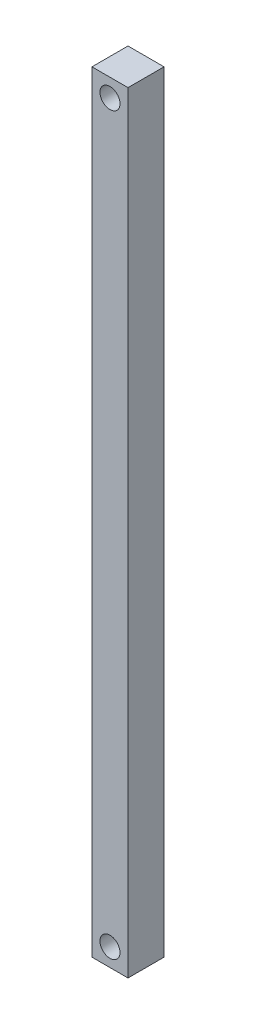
from build123d import *

# Parameters (mm, degrees)
SKETCH1_W           = 18.7
SKETCH1_H           = 400
SKETCH1_R           = 5.2
BOSS_EXTRUDE1_DEPTH = 18.7


with BuildPart() as part:
    # Sketch1 → Boss-Extrude1 (new body)
    with BuildSketch(Plane.XY):
        with Locations((5.58034328, 200)):
            Rectangle(SKETCH1_W, SKETCH1_H)
        with Locations((5.58034328, 390.65)):
            Circle(SKETCH1_R, mode=Mode.SUBTRACT)
        with Locations((5.58034328, 9.35)):
            Circle(SKETCH1_R, mode=Mode.SUBTRACT)
    extrude(amount=BOSS_EXTRUDE1_DEPTH)


solid = part.part
